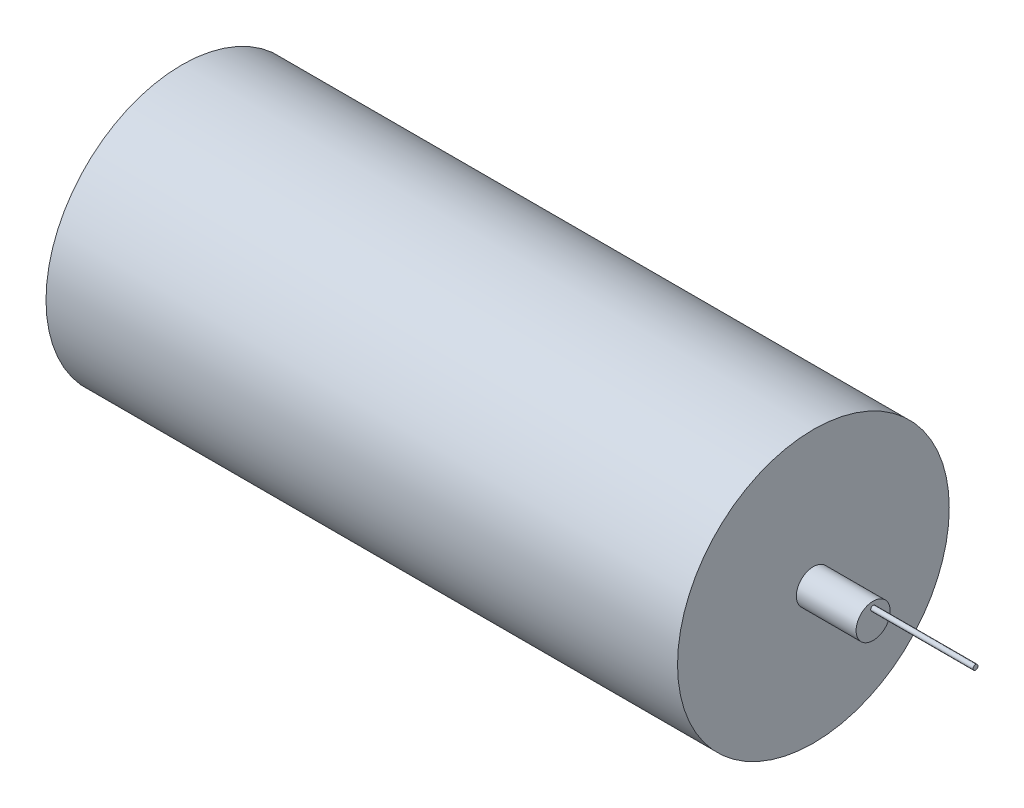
from build123d import *

# Parameters (mm, degrees)
SKETCH1_R           = 199
SKETCH1_R_2         = 195
BOSS_EXTRUDE1_DEPTH = 462.5
BOSS_EXTRUDE2_START = -5
SKETCH2_R           = 195
SKETCH2_R_2         = 25
BOSS_EXTRUDE2_DEPTH = 5
SKETCH3_R           = 25
BOSS_EXTRUDE3_DEPTH = 550
SKETCH4_R           = 3.588343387
BOSS_EXTRUDE4_DEPTH = 150


with BuildPart() as part:
    # Sketch1 → Boss-Extrude1 (new, symmetric)
    with BuildSketch(Plane(origin=(0, 0, 0), x_dir=(0, 0, -1), z_dir=(1, 0, 0))):
        with Locations(Location((0, 0, 0), (0, 0, 180))):
            Circle(SKETCH1_R)
        with Locations(Location((0, 0, 0), (0, 0, 180))):
            Circle(SKETCH1_R_2, mode=Mode.SUBTRACT)
    extrude(amount=BOSS_EXTRUDE1_DEPTH, both=True)

    # Sketch2 → Boss-Extrude2 (add)
    with BuildSketch(Plane(origin=(462.5, 0, 0), x_dir=(0, 0, -1), z_dir=(1, 0, 0)).offset(BOSS_EXTRUDE2_START)):
        with Locations(Location((0, 0, 0), (0, 0, 180))):
            Circle(SKETCH2_R)
        Circle(SKETCH2_R_2, mode=Mode.SUBTRACT)
    boss_extrude2 = extrude(amount=BOSS_EXTRUDE2_DEPTH)

    # Mirror1: Boss-Extrude2 across plane
    add(boss_extrude2.mirror(Plane(origin=(0, 0, 0), x_dir=(0, 0, 1), z_dir=(1, 0, 0))))

    # Sketch3 → Boss-Extrude3 (add, symmetric)
    with BuildSketch(Plane(origin=(0, 0, 0), x_dir=(0, 0, -1), z_dir=(1, 0, 0))):
        Circle(SKETCH3_R)
    extrude(amount=BOSS_EXTRUDE3_DEPTH, both=True)

    # Sketch4 → Boss-Extrude4 (add)
    with BuildSketch(Plane(origin=(550, 0, 0), x_dir=(0, 0, -1), z_dir=(1, 0, 0))):
        with Locations((0, 15.957605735)):
            Circle(SKETCH4_R)
    extrude(amount=BOSS_EXTRUDE4_DEPTH)


solid = part.part
